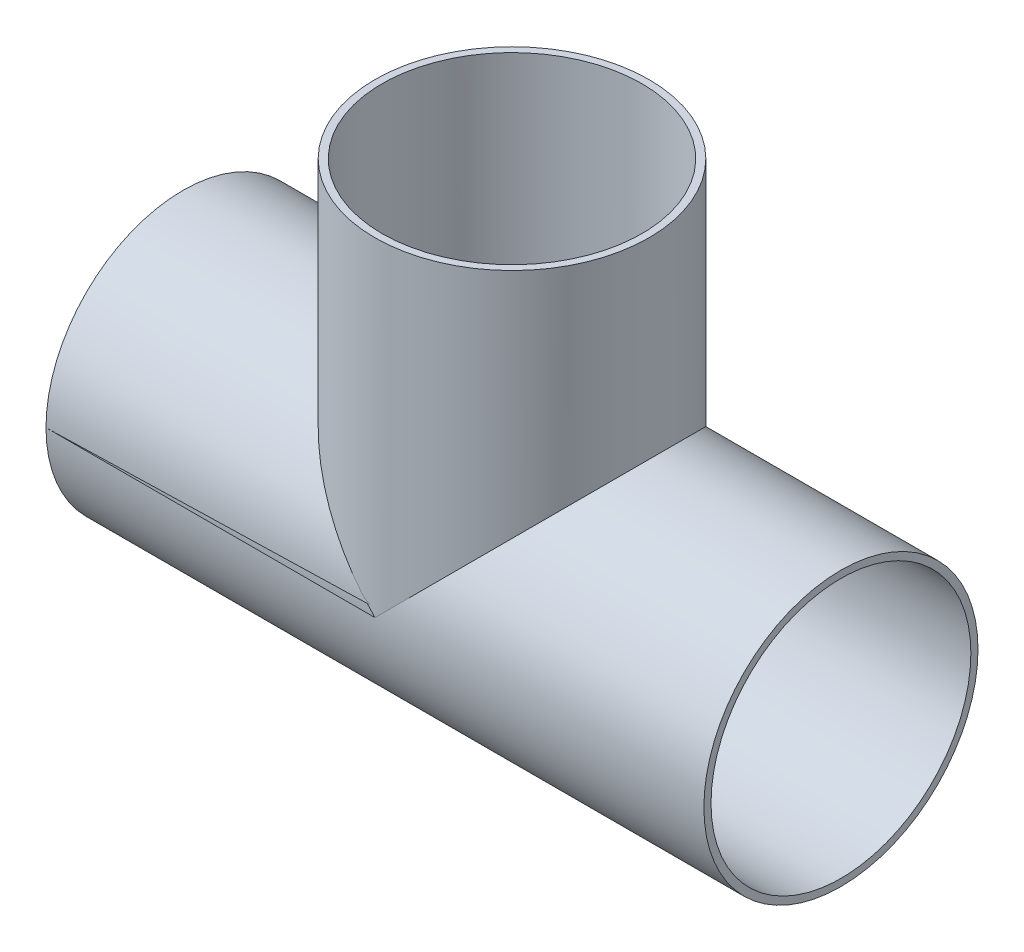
ISO-10303-21;
HEADER;
FILE_DESCRIPTION(('STEP AP214'),'2;1');
FILE_NAME('part.step','',(''),(''),'','','');
FILE_SCHEMA(('AUTOMOTIVE_DESIGN { 1 0 10303 214 1 1 1 1 }'));
ENDSEC;
DATA;
#1=APPLICATION_CONTEXT('core data for automotive mechanical design processes');
#2=APPLICATION_PROTOCOL_DEFINITION('international standard','automotive_design',2000,#1);
#3=PRODUCT_CONTEXT('',#1,'mechanical');
#4=PRODUCT('Part','Part','',(#3));
#5=PRODUCT_RELATED_PRODUCT_CATEGORY('part','',(#4));
#6=PRODUCT_DEFINITION_FORMATION('','',#4);
#7=PRODUCT_DEFINITION_CONTEXT('part definition',#1,'design');
#8=PRODUCT_DEFINITION('design','',#6,#7);
#9=PRODUCT_DEFINITION_SHAPE('','',#8);
#10=(LENGTH_UNIT() NAMED_UNIT(*) SI_UNIT(.MILLI.,.METRE.));
#11=(NAMED_UNIT(*) PLANE_ANGLE_UNIT() SI_UNIT($,.RADIAN.));
#12=(NAMED_UNIT(*) SI_UNIT($,.STERADIAN.) SOLID_ANGLE_UNIT());
#13=UNCERTAINTY_MEASURE_WITH_UNIT(LENGTH_MEASURE(1.E-05),#10,'distance_accuracy_value','');
#14=(GEOMETRIC_REPRESENTATION_CONTEXT(3) GLOBAL_UNCERTAINTY_ASSIGNED_CONTEXT((#13)) GLOBAL_UNIT_ASSIGNED_CONTEXT((#10,
#11,#12)) REPRESENTATION_CONTEXT('',''));
#15=CARTESIAN_POINT('',(0.,0.,0.));
#16=DIRECTION('',(0.,0.,1.));
#17=DIRECTION('',(1.,0.,0.));
#18=AXIS2_PLACEMENT_3D('',#15,#16,#17);
#19=CARTESIAN_POINT('',(0.,76.2,0.));
#20=DIRECTION('',(0.,-1.,0.));
#21=DIRECTION('',(0.,0.,-1.));
#22=AXIS2_PLACEMENT_3D('',#19,#20,#21);
#23=CYLINDRICAL_SURFACE('',#22,31.75);
#24=CARTESIAN_POINT('',(0.,76.2,0.));
#25=DIRECTION('',(0.,1.,0.));
#26=DIRECTION('',(0.,0.,1.));
#27=AXIS2_PLACEMENT_3D('',#24,#25,#26);
#28=CIRCLE('',#27,31.75);
#29=CARTESIAN_POINT('',(0.,76.2,31.75));
#30=VERTEX_POINT('',#29);
#31=EDGE_CURVE('E11',#30,#30,#28,.T.);
#32=ORIENTED_EDGE('',*,*,#31,.F.);
#33=EDGE_LOOP('',(#32));
#34=FACE_BOUND('',#33,.T.);
#35=CARTESIAN_POINT('',(0.,0.,0.));
#36=DIRECTION('',(-0.707106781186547,-0.707106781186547,0.));
#37=DIRECTION('',(0.707106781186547,-0.707106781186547,0.));
#38=AXIS2_PLACEMENT_3D('',#35,#36,#37);
#39=ELLIPSE('',#38,44.9012806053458,31.75);
#40=CARTESIAN_POINT('',(0.,0.,31.75));
#41=VERTEX_POINT('',#40);
#42=CARTESIAN_POINT('',(0.,0.,-31.75));
#43=VERTEX_POINT('',#42);
#44=EDGE_CURVE('E40',#41,#43,#39,.T.);
#45=ORIENTED_EDGE('',*,*,#44,.F.);
#46=CARTESIAN_POINT('',(0.,0.,0.));
#47=DIRECTION('',(0.707106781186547,-0.707106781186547,0.));
#48=DIRECTION('',(-0.707106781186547,-0.707106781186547,0.));
#49=AXIS2_PLACEMENT_3D('',#46,#47,#48);
#50=ELLIPSE('',#49,44.9012806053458,31.75);
#51=EDGE_CURVE('E53',#43,#41,#50,.T.);
#52=ORIENTED_EDGE('',*,*,#51,.F.);
#53=EDGE_LOOP('',(#45,#52));
#54=FACE_BOUND('',#53,.T.);
#55=ADVANCED_FACE('F33',(#34,#54),#23,.T.);
#56=CARTESIAN_POINT('',(0.,76.2,0.));
#57=DIRECTION('',(0.,1.,0.));
#58=DIRECTION('',(0.,0.,1.));
#59=AXIS2_PLACEMENT_3D('',#56,#57,#58);
#60=PLANE('',#59);
#61=CARTESIAN_POINT('',(0.,76.2,0.));
#62=DIRECTION('',(0.,1.,0.));
#63=DIRECTION('',(0.,0.,1.));
#64=AXIS2_PLACEMENT_3D('',#61,#62,#63);
#65=CIRCLE('',#64,30.099);
#66=CARTESIAN_POINT('',(0.,76.2,30.099));
#67=VERTEX_POINT('',#66);
#68=EDGE_CURVE('E65',#67,#67,#65,.T.);
#69=ORIENTED_EDGE('',*,*,#68,.F.);
#70=EDGE_LOOP('',(#69));
#71=FACE_BOUND('',#70,.T.);
#72=ORIENTED_EDGE('',*,*,#31,.T.);
#73=EDGE_LOOP('',(#72));
#74=FACE_BOUND('',#73,.T.);
#75=ADVANCED_FACE('F80',(#71,#74),#60,.T.);
#76=CARTESIAN_POINT('',(76.2,0.,0.));
#77=DIRECTION('',(-1.,0.,0.));
#78=DIRECTION('',(0.,0.,1.));
#79=AXIS2_PLACEMENT_3D('',#76,#77,#78);
#80=CYLINDRICAL_SURFACE('',#79,31.75);
#81=CARTESIAN_POINT('',(-76.2,0.,0.));
#82=DIRECTION('',(1.,0.,0.));
#83=DIRECTION('',(0.,0.,-1.));
#84=AXIS2_PLACEMENT_3D('',#81,#82,#83);
#85=CIRCLE('',#84,31.75);
#86=CARTESIAN_POINT('',(-76.2,0.,-31.75));
#87=VERTEX_POINT('',#86);
#88=EDGE_CURVE('E68',#87,#87,#85,.T.);
#89=ORIENTED_EDGE('',*,*,#88,.T.);
#90=EDGE_LOOP('',(#89));
#91=FACE_BOUND('',#90,.T.);
#92=CARTESIAN_POINT('',(76.2,0.,0.));
#93=DIRECTION('',(1.,0.,0.));
#94=DIRECTION('',(0.,0.,-1.));
#95=AXIS2_PLACEMENT_3D('',#92,#93,#94);
#96=CIRCLE('',#95,31.75);
#97=CARTESIAN_POINT('',(76.2,0.,-31.75));
#98=VERTEX_POINT('',#97);
#99=EDGE_CURVE('E72',#98,#98,#96,.T.);
#100=ORIENTED_EDGE('',*,*,#99,.F.);
#101=EDGE_LOOP('',(#100));
#102=FACE_BOUND('',#101,.T.);
#103=ORIENTED_EDGE('',*,*,#51,.T.);
#104=ORIENTED_EDGE('',*,*,#44,.T.);
#105=EDGE_LOOP('',(#103,#104));
#106=FACE_BOUND('',#105,.T.);
#107=ADVANCED_FACE('F78',(#91,#102,#106),#80,.T.);
#108=CARTESIAN_POINT('',(76.2,0.,0.));
#109=DIRECTION('',(1.,0.,0.));
#110=DIRECTION('',(0.,0.,-1.));
#111=AXIS2_PLACEMENT_3D('',#108,#109,#110);
#112=PLANE('',#111);
#113=CARTESIAN_POINT('',(76.2,0.,0.));
#114=DIRECTION('',(1.,0.,0.));
#115=DIRECTION('',(0.,0.,-1.));
#116=AXIS2_PLACEMENT_3D('',#113,#114,#115);
#117=CIRCLE('',#116,30.099);
#118=CARTESIAN_POINT('',(76.2,0.,-30.099));
#119=VERTEX_POINT('',#118);
#120=EDGE_CURVE('E112',#119,#119,#117,.T.);
#121=ORIENTED_EDGE('',*,*,#120,.F.);
#122=EDGE_LOOP('',(#121));
#123=FACE_BOUND('',#122,.T.);
#124=ORIENTED_EDGE('',*,*,#99,.T.);
#125=EDGE_LOOP('',(#124));
#126=FACE_BOUND('',#125,.T.);
#127=ADVANCED_FACE('F91',(#123,#126),#112,.T.);
#128=CARTESIAN_POINT('',(-76.2,0.,0.));
#129=DIRECTION('',(1.,0.,0.));
#130=DIRECTION('',(0.,0.,-1.));
#131=AXIS2_PLACEMENT_3D('',#128,#129,#130);
#132=PLANE('',#131);
#133=CARTESIAN_POINT('',(-76.2,0.,0.));
#134=DIRECTION('',(1.,0.,0.));
#135=DIRECTION('',(0.,0.,-1.));
#136=AXIS2_PLACEMENT_3D('',#133,#134,#135);
#137=CIRCLE('',#136,30.099);
#138=CARTESIAN_POINT('',(-76.2,0.,-30.099));
#139=VERTEX_POINT('',#138);
#140=EDGE_CURVE('E61',#139,#139,#137,.T.);
#141=ORIENTED_EDGE('',*,*,#140,.T.);
#142=EDGE_LOOP('',(#141));
#143=FACE_BOUND('',#142,.T.);
#144=ORIENTED_EDGE('',*,*,#88,.F.);
#145=EDGE_LOOP('',(#144));
#146=FACE_BOUND('',#145,.T.);
#147=ADVANCED_FACE('F96',(#143,#146),#132,.F.);
#148=CARTESIAN_POINT('',(0.,0.,0.));
#149=DIRECTION('',(0.,1.,0.));
#150=DIRECTION('',(0.,0.,1.));
#151=AXIS2_PLACEMENT_3D('',#148,#149,#150);
#152=CYLINDRICAL_SURFACE('',#151,30.099);
#153=CARTESIAN_POINT('',(0.,0.,0.));
#154=DIRECTION('',(-0.707106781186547,0.707106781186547,0.));
#155=DIRECTION('',(0.707106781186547,0.707106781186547,0.));
#156=AXIS2_PLACEMENT_3D('',#153,#154,#155);
#157=ELLIPSE('',#156,42.5664140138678,30.099);
#158=CARTESIAN_POINT('',(0.,0.,-30.099));
#159=VERTEX_POINT('',#158);
#160=CARTESIAN_POINT('',(0.,0.,30.099));
#161=VERTEX_POINT('',#160);
#162=EDGE_CURVE('E58',#159,#161,#157,.F.);
#163=ORIENTED_EDGE('',*,*,#162,.T.);
#164=CARTESIAN_POINT('',(0.,0.,0.));
#165=DIRECTION('',(0.707106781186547,0.707106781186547,0.));
#166=DIRECTION('',(-0.707106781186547,0.707106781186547,0.));
#167=AXIS2_PLACEMENT_3D('',#164,#165,#166);
#168=ELLIPSE('',#167,42.5664140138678,30.099);
#169=EDGE_CURVE('E46',#161,#159,#168,.F.);
#170=ORIENTED_EDGE('',*,*,#169,.T.);
#171=EDGE_LOOP('',(#163,#170));
#172=FACE_BOUND('',#171,.T.);
#173=ORIENTED_EDGE('',*,*,#68,.T.);
#174=EDGE_LOOP('',(#173));
#175=FACE_BOUND('',#174,.T.);
#176=ADVANCED_FACE('F63',(#172,#175),#152,.F.);
#177=CARTESIAN_POINT('',(-76.2,0.,0.));
#178=DIRECTION('',(1.,0.,0.));
#179=DIRECTION('',(0.,0.,-1.));
#180=AXIS2_PLACEMENT_3D('',#177,#178,#179);
#181=CYLINDRICAL_SURFACE('',#180,30.099);
#182=ORIENTED_EDGE('',*,*,#120,.T.);
#183=EDGE_LOOP('',(#182));
#184=FACE_BOUND('',#183,.T.);
#185=ORIENTED_EDGE('',*,*,#140,.F.);
#186=EDGE_LOOP('',(#185));
#187=FACE_BOUND('',#186,.T.);
#188=ORIENTED_EDGE('',*,*,#162,.F.);
#189=ORIENTED_EDGE('',*,*,#169,.F.);
#190=EDGE_LOOP('',(#188,#189));
#191=FACE_BOUND('',#190,.T.);
#192=ADVANCED_FACE('F59',(#184,#187,#191),#181,.F.);
#193=CLOSED_SHELL('',(#55,#75,#107,#127,#147,#176,#192));
#194=MANIFOLD_SOLID_BREP('B2',#193);
#195=ADVANCED_BREP_SHAPE_REPRESENTATION('',(#18,#194),#14);
#196=SHAPE_DEFINITION_REPRESENTATION(#9,#195);
ENDSEC;
END-ISO-10303-21;
